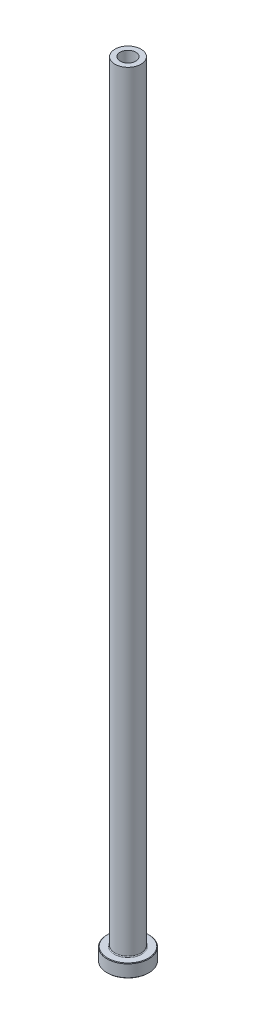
ISO-10303-21;
HEADER;
FILE_DESCRIPTION(('STEP AP214'),'2;1');
FILE_NAME('part.step','',(''),(''),'','','');
FILE_SCHEMA(('AUTOMOTIVE_DESIGN { 1 0 10303 214 1 1 1 1 }'));
ENDSEC;
DATA;
#1=APPLICATION_CONTEXT('core data for automotive mechanical design processes');
#2=APPLICATION_PROTOCOL_DEFINITION('international standard','automotive_design',2000,#1);
#3=PRODUCT_CONTEXT('',#1,'mechanical');
#4=PRODUCT('Part','Part','',(#3));
#5=PRODUCT_RELATED_PRODUCT_CATEGORY('part','',(#4));
#6=PRODUCT_DEFINITION_FORMATION('','',#4);
#7=PRODUCT_DEFINITION_CONTEXT('part definition',#1,'design');
#8=PRODUCT_DEFINITION('design','',#6,#7);
#9=PRODUCT_DEFINITION_SHAPE('','',#8);
#10=(LENGTH_UNIT() NAMED_UNIT(*) SI_UNIT(.MILLI.,.METRE.));
#11=(NAMED_UNIT(*) PLANE_ANGLE_UNIT() SI_UNIT($,.RADIAN.));
#12=(NAMED_UNIT(*) SI_UNIT($,.STERADIAN.) SOLID_ANGLE_UNIT());
#13=UNCERTAINTY_MEASURE_WITH_UNIT(LENGTH_MEASURE(1.E-05),#10,'distance_accuracy_value','');
#14=(GEOMETRIC_REPRESENTATION_CONTEXT(3) GLOBAL_UNCERTAINTY_ASSIGNED_CONTEXT((#13)) GLOBAL_UNIT_ASSIGNED_CONTEXT((#10,
#11,#12)) REPRESENTATION_CONTEXT('',''));
#15=CARTESIAN_POINT('',(0.,0.,0.));
#16=DIRECTION('',(0.,0.,1.));
#17=DIRECTION('',(1.,0.,0.));
#18=AXIS2_PLACEMENT_3D('',#15,#16,#17);
#19=CARTESIAN_POINT('',(0.,92.1876809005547,0.));
#20=DIRECTION('',(0.,1.,0.));
#21=DIRECTION('',(0.,0.,1.));
#22=AXIS2_PLACEMENT_3D('',#19,#20,#21);
#23=CYLINDRICAL_SURFACE('',#22,3.00000000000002);
#24=CARTESIAN_POINT('',(0.,300.,0.));
#25=DIRECTION('',(0.,1.,0.));
#26=DIRECTION('',(0.,0.,1.));
#27=AXIS2_PLACEMENT_3D('',#24,#25,#26);
#28=CIRCLE('',#27,3.00000000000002);
#29=CARTESIAN_POINT('',(0.,300.,3.00000000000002));
#30=VERTEX_POINT('',#29);
#31=EDGE_CURVE('E62',#30,#30,#28,.T.);
#32=ORIENTED_EDGE('',*,*,#31,.T.);
#33=EDGE_LOOP('',(#32));
#34=FACE_BOUND('',#33,.T.);
#35=CARTESIAN_POINT('',(0.,255.,0.));
#36=DIRECTION('',(0.,1.,0.));
#37=DIRECTION('',(0.,0.,1.));
#38=AXIS2_PLACEMENT_3D('',#35,#36,#37);
#39=CIRCLE('',#38,3.00000000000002);
#40=CARTESIAN_POINT('',(0.,255.,3.00000000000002));
#41=VERTEX_POINT('',#40);
#42=EDGE_CURVE('E71',#41,#41,#39,.T.);
#43=ORIENTED_EDGE('',*,*,#42,.F.);
#44=EDGE_LOOP('',(#43));
#45=FACE_BOUND('',#44,.T.);
#46=ADVANCED_FACE('F30',(#34,#45),#23,.F.);
#47=CARTESIAN_POINT('',(-3.00000000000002,300.,0.));
#48=DIRECTION('',(0.,1.,0.));
#49=DIRECTION('',(0.,0.,1.));
#50=AXIS2_PLACEMENT_3D('',#47,#48,#49);
#51=PLANE('',#50);
#52=CARTESIAN_POINT('',(0.,300.,0.));
#53=DIRECTION('',(0.,1.,0.));
#54=DIRECTION('',(0.,0.,1.));
#55=AXIS2_PLACEMENT_3D('',#52,#53,#54);
#56=CIRCLE('',#55,5.00000000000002);
#57=CARTESIAN_POINT('',(0.,300.,5.00000000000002));
#58=VERTEX_POINT('',#57);
#59=EDGE_CURVE('E65',#58,#58,#56,.T.);
#60=ORIENTED_EDGE('',*,*,#59,.T.);
#61=EDGE_LOOP('',(#60));
#62=FACE_BOUND('',#61,.T.);
#63=ORIENTED_EDGE('',*,*,#31,.F.);
#64=EDGE_LOOP('',(#63));
#65=FACE_BOUND('',#64,.T.);
#66=ADVANCED_FACE('F79',(#62,#65),#51,.T.);
#67=CARTESIAN_POINT('',(0.,92.1876809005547,0.));
#68=DIRECTION('',(0.,1.,0.));
#69=DIRECTION('',(0.,0.,1.));
#70=AXIS2_PLACEMENT_3D('',#67,#68,#69);
#71=CYLINDRICAL_SURFACE('',#70,5.00000000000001);
#72=CARTESIAN_POINT('',(0.,5.3,0.));
#73=DIRECTION('',(0.,1.,0.));
#74=DIRECTION('',(0.,0.,1.));
#75=AXIS2_PLACEMENT_3D('',#72,#73,#74);
#76=CIRCLE('',#75,5.00000000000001);
#77=CARTESIAN_POINT('',(0.,5.3,5.00000000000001));
#78=VERTEX_POINT('',#77);
#79=EDGE_CURVE('E59',#78,#78,#76,.T.);
#80=ORIENTED_EDGE('',*,*,#79,.T.);
#81=EDGE_LOOP('',(#80));
#82=FACE_BOUND('',#81,.T.);
#83=ORIENTED_EDGE('',*,*,#59,.F.);
#84=EDGE_LOOP('',(#83));
#85=FACE_BOUND('',#84,.T.);
#86=ADVANCED_FACE('F85',(#82,#85),#71,.T.);
#87=CARTESIAN_POINT('',(-4.99999999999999,5.,0.));
#88=DIRECTION('',(0.,1.,0.));
#89=DIRECTION('',(0.,0.,1.));
#90=AXIS2_PLACEMENT_3D('',#87,#88,#89);
#91=PLANE('',#90);
#92=CARTESIAN_POINT('',(0.,5.,0.));
#93=DIRECTION('',(0.,1.,0.));
#94=DIRECTION('',(0.,0.,1.));
#95=AXIS2_PLACEMENT_3D('',#92,#93,#94);
#96=CIRCLE('',#95,7.79999999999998);
#97=CARTESIAN_POINT('',(0.,5.,7.79999999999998));
#98=VERTEX_POINT('',#97);
#99=EDGE_CURVE('E53',#98,#98,#96,.T.);
#100=ORIENTED_EDGE('',*,*,#99,.T.);
#101=EDGE_LOOP('',(#100));
#102=FACE_BOUND('',#101,.T.);
#103=CARTESIAN_POINT('',(0.,5.,0.));
#104=DIRECTION('',(0.,1.,0.));
#105=DIRECTION('',(0.,0.,1.));
#106=AXIS2_PLACEMENT_3D('',#103,#104,#105);
#107=CIRCLE('',#106,5.30000000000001);
#108=CARTESIAN_POINT('',(0.,5.,5.30000000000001));
#109=VERTEX_POINT('',#108);
#110=EDGE_CURVE('E56',#109,#109,#107,.F.);
#111=ORIENTED_EDGE('',*,*,#110,.T.);
#112=EDGE_LOOP('',(#111));
#113=FACE_BOUND('',#112,.T.);
#114=ADVANCED_FACE('F111',(#102,#113),#91,.T.);
#115=CARTESIAN_POINT('',(0.,92.1876809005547,0.));
#116=DIRECTION('',(0.,1.,0.));
#117=DIRECTION('',(0.,0.,1.));
#118=AXIS2_PLACEMENT_3D('',#115,#116,#117);
#119=CYLINDRICAL_SURFACE('',#118,7.99999999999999);
#120=CARTESIAN_POINT('',(0.,4.79999999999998,0.));
#121=DIRECTION('',(0.,1.,0.));
#122=DIRECTION('',(0.,0.,1.));
#123=AXIS2_PLACEMENT_3D('',#120,#121,#122);
#124=CIRCLE('',#123,7.99999999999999);
#125=CARTESIAN_POINT('',(0.,4.79999999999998,7.99999999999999));
#126=VERTEX_POINT('',#125);
#127=EDGE_CURVE('E45',#126,#126,#124,.F.);
#128=ORIENTED_EDGE('',*,*,#127,.T.);
#129=EDGE_LOOP('',(#128));
#130=FACE_BOUND('',#129,.T.);
#131=CARTESIAN_POINT('',(0.,0.199999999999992,0.));
#132=DIRECTION('',(0.,-1.,0.));
#133=DIRECTION('',(0.,0.,-1.));
#134=AXIS2_PLACEMENT_3D('',#131,#132,#133);
#135=CIRCLE('',#134,7.99999999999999);
#136=CARTESIAN_POINT('',(0.,0.199999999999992,-7.99999999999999));
#137=VERTEX_POINT('',#136);
#138=EDGE_CURVE('E50',#137,#137,#135,.F.);
#139=ORIENTED_EDGE('',*,*,#138,.T.);
#140=EDGE_LOOP('',(#139));
#141=FACE_BOUND('',#140,.T.);
#142=ADVANCED_FACE('F108',(#130,#141),#119,.T.);
#143=CARTESIAN_POINT('',(-7.99999999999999,0.,0.));
#144=DIRECTION('',(0.,-1.,0.));
#145=DIRECTION('',(0.,0.,-1.));
#146=AXIS2_PLACEMENT_3D('',#143,#144,#145);
#147=PLANE('',#146);
#148=CARTESIAN_POINT('',(0.,0.,0.));
#149=DIRECTION('',(0.,-1.,0.));
#150=DIRECTION('',(0.,0.,-1.));
#151=AXIS2_PLACEMENT_3D('',#148,#149,#150);
#152=CIRCLE('',#151,3.75000000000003);
#153=CARTESIAN_POINT('',(0.,0.,-3.75000000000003));
#154=VERTEX_POINT('',#153);
#155=EDGE_CURVE('E37',#154,#154,#152,.F.);
#156=ORIENTED_EDGE('',*,*,#155,.T.);
#157=EDGE_LOOP('',(#156));
#158=FACE_BOUND('',#157,.T.);
#159=CARTESIAN_POINT('',(0.,0.,0.));
#160=DIRECTION('',(0.,-1.,0.));
#161=DIRECTION('',(0.,0.,-1.));
#162=AXIS2_PLACEMENT_3D('',#159,#160,#161);
#163=CIRCLE('',#162,7.80000000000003);
#164=CARTESIAN_POINT('',(0.,0.,-7.80000000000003));
#165=VERTEX_POINT('',#164);
#166=EDGE_CURVE('E41',#165,#165,#163,.T.);
#167=ORIENTED_EDGE('',*,*,#166,.T.);
#168=EDGE_LOOP('',(#167));
#169=FACE_BOUND('',#168,.T.);
#170=ADVANCED_FACE('F110',(#158,#169),#147,.T.);
#171=CARTESIAN_POINT('',(0.,92.1876809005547,0.));
#172=DIRECTION('',(0.,1.,0.));
#173=DIRECTION('',(0.,0.,1.));
#174=AXIS2_PLACEMENT_3D('',#171,#172,#173);
#175=CYLINDRICAL_SURFACE('',#174,3.25);
#176=CARTESIAN_POINT('',(0.,0.499999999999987,0.));
#177=DIRECTION('',(0.,-1.,0.));
#178=DIRECTION('',(0.,0.,-1.));
#179=AXIS2_PLACEMENT_3D('',#176,#177,#178);
#180=CIRCLE('',#179,3.25);
#181=CARTESIAN_POINT('',(0.,0.499999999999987,-3.25));
#182=VERTEX_POINT('',#181);
#183=EDGE_CURVE('E10',#182,#182,#180,.T.);
#184=ORIENTED_EDGE('',*,*,#183,.T.);
#185=EDGE_LOOP('',(#184));
#186=FACE_BOUND('',#185,.T.);
#187=CARTESIAN_POINT('',(0.,243.,0.));
#188=DIRECTION('',(0.,1.,0.));
#189=DIRECTION('',(0.,0.,1.));
#190=AXIS2_PLACEMENT_3D('',#187,#188,#189);
#191=CIRCLE('',#190,3.25000000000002);
#192=CARTESIAN_POINT('',(0.,243.,3.25000000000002));
#193=VERTEX_POINT('',#192);
#194=EDGE_CURVE('E68',#193,#193,#191,.T.);
#195=ORIENTED_EDGE('',*,*,#194,.T.);
#196=EDGE_LOOP('',(#195));
#197=FACE_BOUND('',#196,.T.);
#198=ADVANCED_FACE('F118',(#186,#197),#175,.F.);
#199=CARTESIAN_POINT('',(0.,243.,0.));
#200=DIRECTION('',(0.,-1.,0.));
#201=DIRECTION('',(0.,0.,-1.));
#202=AXIS2_PLACEMENT_3D('',#199,#200,#201);
#203=CONICAL_SURFACE('',#202,3.25000000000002,0.0208303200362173);
#204=ORIENTED_EDGE('',*,*,#42,.T.);
#205=EDGE_LOOP('',(#204));
#206=FACE_BOUND('',#205,.T.);
#207=ORIENTED_EDGE('',*,*,#194,.F.);
#208=EDGE_LOOP('',(#207));
#209=FACE_BOUND('',#208,.T.);
#210=ADVANCED_FACE('F75',(#206,#209),#203,.F.);
#211=CARTESIAN_POINT('',(0.,5.3,0.));
#212=DIRECTION('',(0.,1.,0.));
#213=DIRECTION('',(0.,0.,1.));
#214=AXIS2_PLACEMENT_3D('',#211,#212,#213);
#215=TOROIDAL_SURFACE('',#214,5.30000000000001,0.3);
#216=ORIENTED_EDGE('',*,*,#110,.F.);
#217=EDGE_LOOP('',(#216));
#218=FACE_BOUND('',#217,.T.);
#219=ORIENTED_EDGE('',*,*,#79,.F.);
#220=EDGE_LOOP('',(#219));
#221=FACE_BOUND('',#220,.T.);
#222=ADVANCED_FACE('F90',(#218,#221),#215,.F.);
#223=CARTESIAN_POINT('',(0.,5.,0.));
#224=DIRECTION('',(0.,-1.,0.));
#225=DIRECTION('',(0.,0.,-1.));
#226=AXIS2_PLACEMENT_3D('',#223,#224,#225);
#227=CONICAL_SURFACE('',#226,7.79999999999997,0.78539816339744);
#228=ORIENTED_EDGE('',*,*,#127,.F.);
#229=EDGE_LOOP('',(#228));
#230=FACE_BOUND('',#229,.T.);
#231=ORIENTED_EDGE('',*,*,#99,.F.);
#232=EDGE_LOOP('',(#231));
#233=FACE_BOUND('',#232,.T.);
#234=ADVANCED_FACE('F93',(#230,#233),#227,.T.);
#235=CARTESIAN_POINT('',(0.,0.199999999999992,0.));
#236=DIRECTION('',(0.,1.,0.));
#237=DIRECTION('',(0.,0.,1.));
#238=AXIS2_PLACEMENT_3D('',#235,#236,#237);
#239=CONICAL_SURFACE('',#238,7.99999999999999,0.78539816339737);
#240=ORIENTED_EDGE('',*,*,#166,.F.);
#241=EDGE_LOOP('',(#240));
#242=FACE_BOUND('',#241,.T.);
#243=ORIENTED_EDGE('',*,*,#138,.F.);
#244=EDGE_LOOP('',(#243));
#245=FACE_BOUND('',#244,.T.);
#246=ADVANCED_FACE('F96',(#242,#245),#239,.T.);
#247=CARTESIAN_POINT('',(0.,0.,0.));
#248=DIRECTION('',(0.,-1.,0.));
#249=DIRECTION('',(0.,0.,-1.));
#250=AXIS2_PLACEMENT_3D('',#247,#248,#249);
#251=CONICAL_SURFACE('',#250,3.75000000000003,0.785398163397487);
#252=ORIENTED_EDGE('',*,*,#183,.F.);
#253=EDGE_LOOP('',(#252));
#254=FACE_BOUND('',#253,.T.);
#255=ORIENTED_EDGE('',*,*,#155,.F.);
#256=EDGE_LOOP('',(#255));
#257=FACE_BOUND('',#256,.T.);
#258=ADVANCED_FACE('F32',(#254,#257),#251,.F.);
#259=CLOSED_SHELL('',(#46,#66,#86,#114,#142,#170,#198,#210,#222,#234,#246,#258));
#260=MANIFOLD_SOLID_BREP('B2',#259);
#261=ADVANCED_BREP_SHAPE_REPRESENTATION('',(#18,#260),#14);
#262=SHAPE_DEFINITION_REPRESENTATION(#9,#261);
ENDSEC;
END-ISO-10303-21;
